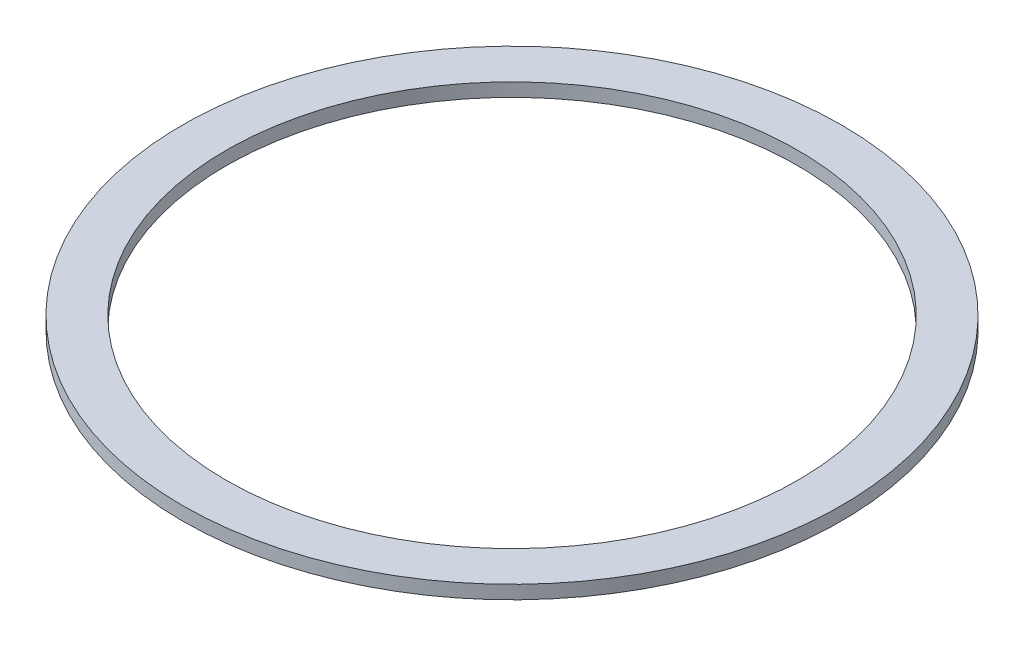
from build123d import *

# Parameters (mm, degrees)
SCHIZZO1_R                   = 98
SCHIZZO1_R_2                 = 85
ESTRUSIONE_ESTRUSIONE1_DEPTH = 4


with BuildPart() as part:
    # Schizzo1 → Estrusione-Estrusione1 (new body)
    with BuildSketch(Plane(origin=(0, 0, 0), x_dir=(1, 0, 0), z_dir=(0, 1, 0))):
        with Locations(Location((0, 0, 0), (0, 0, 270))):
            Circle(SCHIZZO1_R)
        with Locations(Location((0, 0, 0), (0, 0, 270))):
            Circle(SCHIZZO1_R_2, mode=Mode.SUBTRACT)
    extrude(amount=ESTRUSIONE_ESTRUSIONE1_DEPTH)


solid = part.part
